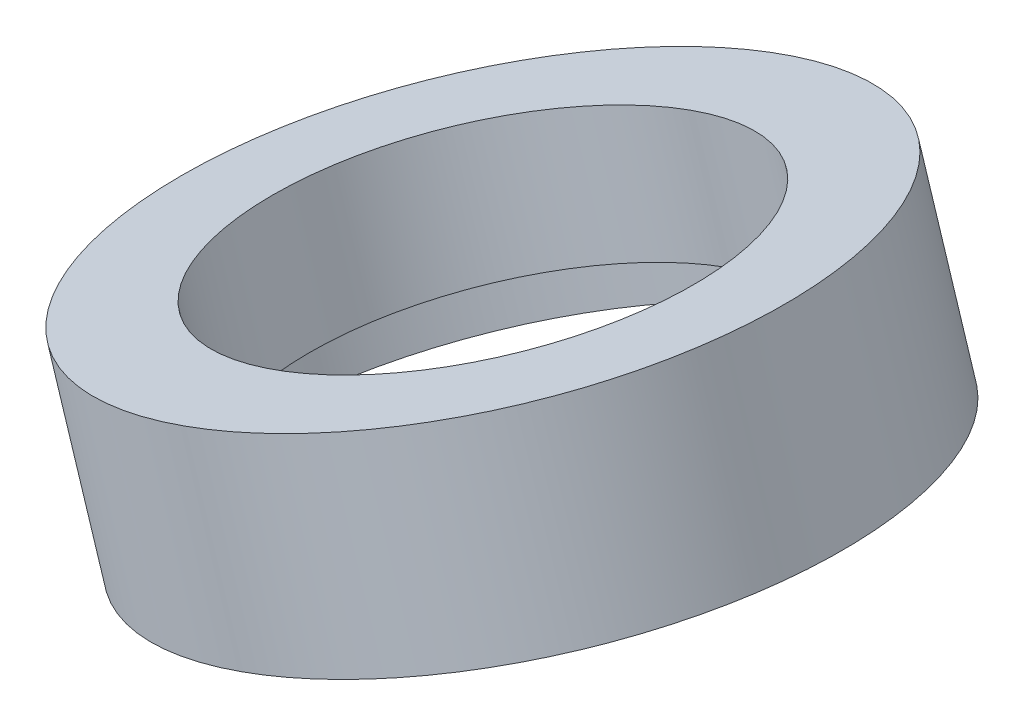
ISO-10303-21;
HEADER;
FILE_DESCRIPTION(('STEP AP214'),'2;1');
FILE_NAME('part.step','',(''),(''),'','','');
FILE_SCHEMA(('AUTOMOTIVE_DESIGN { 1 0 10303 214 1 1 1 1 }'));
ENDSEC;
DATA;
#1=APPLICATION_CONTEXT('core data for automotive mechanical design processes');
#2=APPLICATION_PROTOCOL_DEFINITION('international standard','automotive_design',2000,#1);
#3=PRODUCT_CONTEXT('',#1,'mechanical');
#4=PRODUCT('Part','Part','',(#3));
#5=PRODUCT_RELATED_PRODUCT_CATEGORY('part','',(#4));
#6=PRODUCT_DEFINITION_FORMATION('','',#4);
#7=PRODUCT_DEFINITION_CONTEXT('part definition',#1,'design');
#8=PRODUCT_DEFINITION('design','',#6,#7);
#9=PRODUCT_DEFINITION_SHAPE('','',#8);
#10=(LENGTH_UNIT() NAMED_UNIT(*) SI_UNIT(.MILLI.,.METRE.));
#11=(NAMED_UNIT(*) PLANE_ANGLE_UNIT() SI_UNIT($,.RADIAN.));
#12=(NAMED_UNIT(*) SI_UNIT($,.STERADIAN.) SOLID_ANGLE_UNIT());
#13=UNCERTAINTY_MEASURE_WITH_UNIT(LENGTH_MEASURE(1.E-05),#10,'distance_accuracy_value','');
#14=(GEOMETRIC_REPRESENTATION_CONTEXT(3) GLOBAL_UNCERTAINTY_ASSIGNED_CONTEXT((#13)) GLOBAL_UNIT_ASSIGNED_CONTEXT((#10,
#11,#12)) REPRESENTATION_CONTEXT('',''));
#15=CARTESIAN_POINT('',(0.,0.,0.));
#16=DIRECTION('',(0.,0.,1.));
#17=DIRECTION('',(1.,0.,0.));
#18=AXIS2_PLACEMENT_3D('',#15,#16,#17);
#19=CARTESIAN_POINT('',(358.278571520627,555.511428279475,0.));
#20=DIRECTION('',(-0.300714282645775,0.953714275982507,0.));
#21=DIRECTION('',(-0.953714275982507,-0.300714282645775,0.));
#22=AXIS2_PLACEMENT_3D('',#19,#20,#21);
#23=CYLINDRICAL_SURFACE('',#22,14.3);
#24=CARTESIAN_POINT('',(362.187857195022,543.113142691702,0.));
#25=DIRECTION('',(-0.300714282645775,0.953714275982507,0.));
#26=DIRECTION('',(-0.953714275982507,-0.300714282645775,0.));
#27=AXIS2_PLACEMENT_3D('',#24,#25,#26);
#28=CIRCLE('',#27,14.3);
#29=CARTESIAN_POINT('',(348.549743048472,538.812928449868,0.));
#30=VERTEX_POINT('',#29);
#31=EDGE_CURVE('E54',#30,#30,#28,.T.);
#32=ORIENTED_EDGE('',*,*,#31,.F.);
#33=EDGE_LOOP('',(#32));
#34=FACE_BOUND('',#33,.T.);
#35=CARTESIAN_POINT('',(359.782142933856,550.742856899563,0.));
#36=DIRECTION('',(-0.300714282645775,0.953714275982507,0.));
#37=DIRECTION('',(-0.953714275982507,-0.300714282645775,0.));
#38=AXIS2_PLACEMENT_3D('',#35,#36,#37);
#39=CIRCLE('',#38,14.3000000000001);
#40=CARTESIAN_POINT('',(346.144028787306,546.442642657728,0.));
#41=VERTEX_POINT('',#40);
#42=EDGE_CURVE('E10',#41,#41,#39,.T.);
#43=ORIENTED_EDGE('',*,*,#42,.T.);
#44=EDGE_LOOP('',(#43));
#45=FACE_BOUND('',#44,.T.);
#46=ADVANCED_FACE('F32',(#34,#45),#23,.F.);
#47=CARTESIAN_POINT('',(373.420257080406,555.043071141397,0.));
#48=DIRECTION('',(0.300714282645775,-0.953714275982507,0.));
#49=DIRECTION('',(0.953714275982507,0.300714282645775,0.));
#50=AXIS2_PLACEMENT_3D('',#47,#48,#49);
#51=PLANE('',#50);
#52=ORIENTED_EDGE('',*,*,#42,.F.);
#53=EDGE_LOOP('',(#52));
#54=FACE_BOUND('',#53,.T.);
#55=CARTESIAN_POINT('',(359.782142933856,550.742856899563,0.));
#56=DIRECTION('',(-0.300714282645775,0.953714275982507,0.));
#57=DIRECTION('',(-0.953714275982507,-0.300714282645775,0.));
#58=AXIS2_PLACEMENT_3D('',#55,#56,#57);
#59=CIRCLE('',#58,20.5);
#60=CARTESIAN_POINT('',(340.231000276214,544.578214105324,0.));
#61=VERTEX_POINT('',#60);
#62=EDGE_CURVE('E38',#61,#61,#59,.T.);
#63=ORIENTED_EDGE('',*,*,#62,.T.);
#64=EDGE_LOOP('',(#63));
#65=FACE_BOUND('',#64,.T.);
#66=ADVANCED_FACE('F61',(#54,#65),#51,.F.);
#67=CARTESIAN_POINT('',(358.278571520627,555.511428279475,0.));
#68=DIRECTION('',(-0.300714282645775,0.953714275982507,0.));
#69=DIRECTION('',(-0.953714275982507,-0.300714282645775,0.));
#70=AXIS2_PLACEMENT_3D('',#67,#68,#69);
#71=CYLINDRICAL_SURFACE('',#70,20.5);
#72=ORIENTED_EDGE('',*,*,#62,.F.);
#73=EDGE_LOOP('',(#72));
#74=FACE_BOUND('',#73,.T.);
#75=CARTESIAN_POINT('',(363.541071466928,538.821428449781,0.));
#76=DIRECTION('',(-0.300714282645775,0.953714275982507,0.));
#77=DIRECTION('',(-0.953714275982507,-0.300714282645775,0.));
#78=AXIS2_PLACEMENT_3D('',#75,#76,#77);
#79=CIRCLE('',#78,20.5);
#80=CARTESIAN_POINT('',(343.989928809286,532.656785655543,0.));
#81=VERTEX_POINT('',#80);
#82=EDGE_CURVE('E42',#81,#81,#79,.T.);
#83=ORIENTED_EDGE('',*,*,#82,.T.);
#84=EDGE_LOOP('',(#83));
#85=FACE_BOUND('',#84,.T.);
#86=ADVANCED_FACE('F65',(#74,#85),#71,.T.);
#87=CARTESIAN_POINT('',(383.092214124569,544.98607124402,0.));
#88=DIRECTION('',(-0.300714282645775,0.953714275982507,0.));
#89=DIRECTION('',(-0.953714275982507,-0.300714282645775,0.));
#90=AXIS2_PLACEMENT_3D('',#87,#88,#89);
#91=PLANE('',#90);
#92=ORIENTED_EDGE('',*,*,#82,.F.);
#93=EDGE_LOOP('',(#92));
#94=FACE_BOUND('',#93,.T.);
#95=CARTESIAN_POINT('',(363.541071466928,538.821428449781,0.));
#96=DIRECTION('',(-0.300714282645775,0.953714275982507,0.));
#97=DIRECTION('',(-0.953714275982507,-0.300714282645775,0.));
#98=AXIS2_PLACEMENT_3D('',#95,#96,#97);
#99=CIRCLE('',#98,19.6);
#100=CARTESIAN_POINT('',(344.848271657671,532.927428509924,0.));
#101=VERTEX_POINT('',#100);
#102=EDGE_CURVE('E46',#101,#101,#99,.T.);
#103=ORIENTED_EDGE('',*,*,#102,.T.);
#104=EDGE_LOOP('',(#103));
#105=FACE_BOUND('',#104,.T.);
#106=ADVANCED_FACE('F70',(#94,#105),#91,.F.);
#107=CARTESIAN_POINT('',(358.278571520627,555.511428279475,0.));
#108=DIRECTION('',(-0.300714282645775,0.953714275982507,0.));
#109=DIRECTION('',(-0.953714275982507,-0.300714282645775,0.));
#110=AXIS2_PLACEMENT_3D('',#107,#108,#109);
#111=CYLINDRICAL_SURFACE('',#110,19.6);
#112=ORIENTED_EDGE('',*,*,#102,.F.);
#113=EDGE_LOOP('',(#112));
#114=FACE_BOUND('',#113,.T.);
#115=CARTESIAN_POINT('',(362.187857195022,543.113142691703,0.));
#116=DIRECTION('',(-0.300714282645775,0.953714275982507,0.));
#117=DIRECTION('',(-0.953714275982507,-0.300714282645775,0.));
#118=AXIS2_PLACEMENT_3D('',#115,#116,#117);
#119=CIRCLE('',#118,19.6);
#120=CARTESIAN_POINT('',(343.495057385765,537.219142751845,0.));
#121=VERTEX_POINT('',#120);
#122=EDGE_CURVE('E51',#121,#121,#119,.T.);
#123=ORIENTED_EDGE('',*,*,#122,.T.);
#124=EDGE_LOOP('',(#123));
#125=FACE_BOUND('',#124,.T.);
#126=ADVANCED_FACE('F76',(#114,#125),#111,.F.);
#127=CARTESIAN_POINT('',(380.880657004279,549.00714263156,0.));
#128=DIRECTION('',(-0.300714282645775,0.953714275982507,0.));
#129=DIRECTION('',(-0.953714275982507,-0.300714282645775,0.));
#130=AXIS2_PLACEMENT_3D('',#127,#128,#129);
#131=PLANE('',#130);
#132=ORIENTED_EDGE('',*,*,#122,.F.);
#133=EDGE_LOOP('',(#132));
#134=FACE_BOUND('',#133,.T.);
#135=ORIENTED_EDGE('',*,*,#31,.T.);
#136=EDGE_LOOP('',(#135));
#137=FACE_BOUND('',#136,.T.);
#138=ADVANCED_FACE('F58',(#134,#137),#131,.F.);
#139=CLOSED_SHELL('',(#46,#66,#86,#106,#126,#138));
#140=MANIFOLD_SOLID_BREP('B2',#139);
#141=ADVANCED_BREP_SHAPE_REPRESENTATION('',(#18,#140),#14);
#142=SHAPE_DEFINITION_REPRESENTATION(#9,#141);
ENDSEC;
END-ISO-10303-21;
